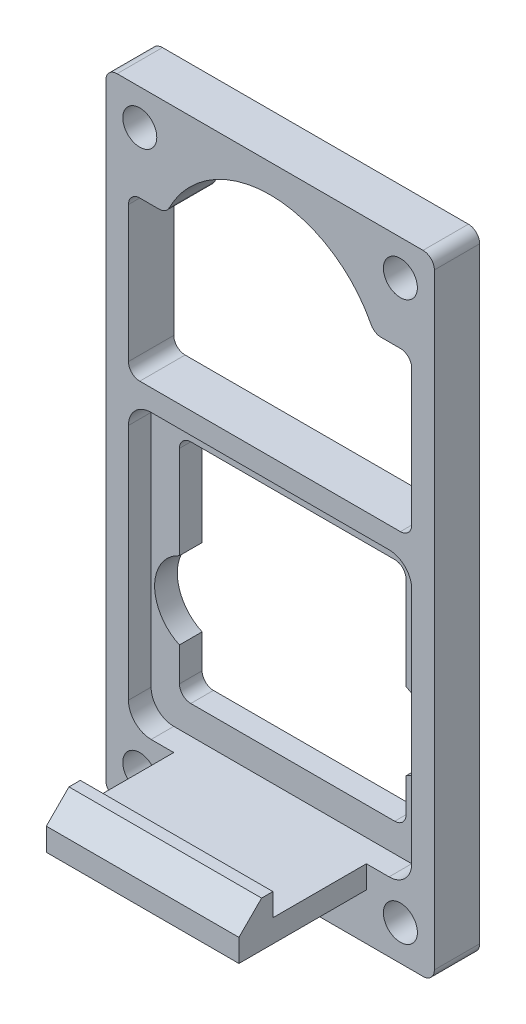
from build123d import *

# Parameters (mm, degrees)
SKETCH1_W             = 29
SKETCH1_H             = 55.5
BODY_DEPTH            = 4
SKETCH2_R             = 1.5
BOLT_HOLES_DEPTH      = 63.747509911
SERVO_CLEARANCE_DEPTH = 63.747509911
SKETCH4_W             = 25
SKETCH4_H             = 25
FAN_RECESS_DEPTH      = 2
CLAMP_FILLETS_R       = 1
FAN_FILLETS_R         = 2
SKETCH5_W             = 17
SKETCH5_H             = 2
CLAMP_BASE_DEPTH      = 8.25
CLAMP_HOOK_DEPTH      = 17


with BuildPart() as part:
    # Sketch1 → Body (new body)
    with BuildSketch(Plane.XY):
        with Locations((14.5, 27.75)):
            Rectangle(SKETCH1_W, SKETCH1_H)
    extrude(amount=BODY_DEPTH)

    # Sketch2 → Bolt Holes (cut, through all)
    with BuildSketch(Plane.XY.offset(4)):
        with Locations((3, 52.385)):
            Circle(SKETCH2_R)
        with Locations(Location((26, 52.385, 0), (0, 0, 180))):
            Circle(SKETCH2_R)
        with Locations((26, 3.115)):
            Circle(SKETCH2_R)
        with Locations(Location((3, 3.115, 0), (0, 0, 180))):
            Circle(SKETCH2_R)
    extrude(amount=-BOLT_HOLES_DEPTH, mode=Mode.SUBTRACT)

    # Sketch3 → Servo Clearance (cut, through all)
    with BuildSketch(Plane.XY.offset(4)):
        with BuildLine():
            Line((4.5, 12.5898827), (4.5, 8.615))
            Line((4.5, 8.615), (24.5, 8.615))
            Line((24.5, 8.615), (24.5, 12.5898827))
            ThreePointArc((24.5, 12.5898827), (26.69, 16), (24.5, 19.4101173))
            Line((24.5, 19.4101173), (24.5, 28.615))
            Line((24.5, 28.615), (4.5, 28.615))
            Line((4.5, 28.615), (4.5, 19.4101173))
            ThreePointArc((4.5, 19.4101173), (2.31, 16), (4.5, 12.5898827))
        make_face()
        with BuildLine():
            Line((2, 47), (5.33484861, 47))
            ThreePointArc((5.33484861, 47), (14.5, 53), (23.66515139, 47))
            Line((23.66515139, 47), (27, 47))
            Line((27, 47), (27, 33))
            Line((27, 33), (2, 33))
            Line((2, 33), (2, 47))
        make_face()
    extrude(amount=-SERVO_CLEARANCE_DEPTH, mode=Mode.SUBTRACT)

    # Sketch4 → Fan Recess (cut)
    with BuildSketch(Plane.XY.offset(4)):
        with Locations((14.5, 18.615)):
            Rectangle(SKETCH4_W, SKETCH4_H)
    extrude(amount=-FAN_RECESS_DEPTH, mode=Mode.SUBTRACT)

    # Clamp Fillets
    clamp_fillets_edges = [part.edges().sort_by_distance(p)[0] for p in [
        (4.5, 28.615, 1),
        (24.5, 28.615, 1),
        (24.5, 8.615, 1),
        (4.5, 8.615, 1),
        (2, 33, 2),
        (2, 47, 2),
        (5.33484861, 47, 2),
        (23.66515139, 47, 2),
        (27, 47, 2),
        (27, 33, 2),
        (0, 55.5, 2),
        (29, 55.5, 2),
        (29, 0, 2),
        (0, 0, 2),
    ]]
    fillet(clamp_fillets_edges, radius=CLAMP_FILLETS_R)

    # Fan Fillets
    fan_fillets_edges = [part.edges().sort_by_distance(p)[0] for p in [
        (27, 6.115, 3),
        (27, 31.115, 3),
        (2, 31.115, 3),
        (2, 6.115, 3),
    ]]
    fillet(fan_fillets_edges, radius=FAN_FILLETS_R)

    # Sketch5 → Clamp Base (add)
    with BuildSketch(Plane.XY.offset(4)):
        with Locations((14.5, 5.115)):
            Rectangle(SKETCH5_W, SKETCH5_H)
    extrude(amount=CLAMP_BASE_DEPTH)

    # Sketch7 → Clamp Hook (add)
    with BuildSketch(Plane.ZY.offset(-6)):
        Polygon((12.25, 4.115), (15.25, 4.115), (15.25, 6.115), (13.25, 8.115), (12.25, 8.115), align=None)
    extrude(amount=-CLAMP_HOOK_DEPTH)


solid = part.part
